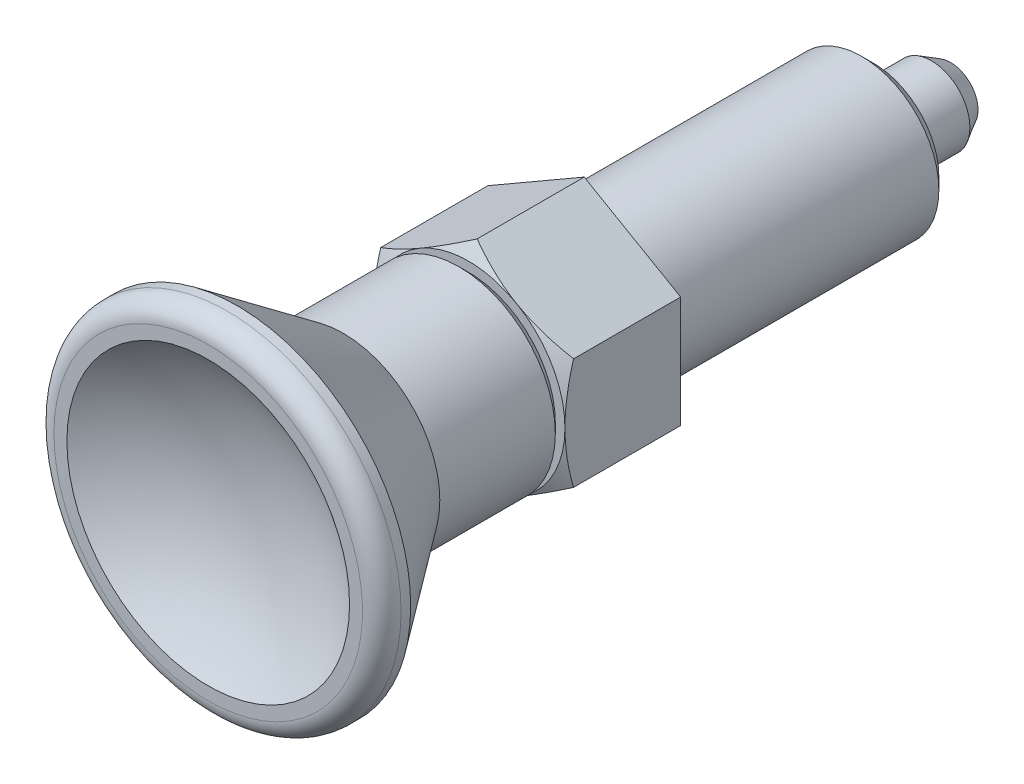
ISO-10303-21;
HEADER;
FILE_DESCRIPTION(('STEP AP214'),'2;1');
FILE_NAME('part.step','',(''),(''),'','','');
FILE_SCHEMA(('AUTOMOTIVE_DESIGN { 1 0 10303 214 1 1 1 1 }'));
ENDSEC;
DATA;
#1=APPLICATION_CONTEXT('core data for automotive mechanical design processes');
#2=APPLICATION_PROTOCOL_DEFINITION('international standard','automotive_design',2000,#1);
#3=PRODUCT_CONTEXT('',#1,'mechanical');
#4=PRODUCT('Part','Part','',(#3));
#5=PRODUCT_RELATED_PRODUCT_CATEGORY('part','',(#4));
#6=PRODUCT_DEFINITION_FORMATION('','',#4);
#7=PRODUCT_DEFINITION_CONTEXT('part definition',#1,'design');
#8=PRODUCT_DEFINITION('design','',#6,#7);
#9=PRODUCT_DEFINITION_SHAPE('','',#8);
#10=(LENGTH_UNIT() NAMED_UNIT(*) SI_UNIT(.MILLI.,.METRE.));
#11=(NAMED_UNIT(*) PLANE_ANGLE_UNIT() SI_UNIT($,.RADIAN.));
#12=(NAMED_UNIT(*) SI_UNIT($,.STERADIAN.) SOLID_ANGLE_UNIT());
#13=UNCERTAINTY_MEASURE_WITH_UNIT(LENGTH_MEASURE(1.E-05),#10,'distance_accuracy_value','');
#14=(GEOMETRIC_REPRESENTATION_CONTEXT(3) GLOBAL_UNCERTAINTY_ASSIGNED_CONTEXT((#13)) GLOBAL_UNIT_ASSIGNED_CONTEXT((#10,
#11,#12)) REPRESENTATION_CONTEXT('',''));
#15=CARTESIAN_POINT('',(0.,0.,0.));
#16=DIRECTION('',(0.,0.,1.));
#17=DIRECTION('',(1.,0.,0.));
#18=AXIS2_PLACEMENT_3D('',#15,#16,#17);
#19=CARTESIAN_POINT('',(5.,2.88675134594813,6.));
#20=DIRECTION('',(-0.5,-0.866025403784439,0.));
#21=DIRECTION('',(0.866025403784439,-0.5,0.));
#22=AXIS2_PLACEMENT_3D('',#19,#20,#21);
#23=PLANE('',#22);
#24=CARTESIAN_POINT('',(5.0002,2.88663587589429,5.55335134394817));
#25=CARTESIAN_POINT('',(4.78046540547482,3.01349970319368,5.62661343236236));
#26=CARTESIAN_POINT('',(4.55885141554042,3.14144859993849,5.69324867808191));
#27=CARTESIAN_POINT('',(4.11178600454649,3.39956193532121,5.80956100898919));
#28=CARTESIAN_POINT('',(3.88632664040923,3.52973095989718,5.85919695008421));
#29=CARTESIAN_POINT('',(3.43816769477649,3.78847564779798,5.9364489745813));
#30=CARTESIAN_POINT('',(3.21553790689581,3.91701101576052,5.96457962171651));
#31=CARTESIAN_POINT('',(2.88081009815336,4.11026620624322,5.98980507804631));
#32=CARTESIAN_POINT('',(2.76915780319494,4.17472868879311,5.99538654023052));
#33=CARTESIAN_POINT('',(2.5457500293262,4.30371322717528,6.00079778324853));
#34=CARTESIAN_POINT('',(2.43399455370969,4.36823528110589,6.0006277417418));
#35=CARTESIAN_POINT('',(2.12781576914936,4.54500768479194,5.99224636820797));
#36=CARTESIAN_POINT('',(1.93349391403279,4.65719946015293,5.97817022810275));
#37=CARTESIAN_POINT('',(1.54613989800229,4.88083840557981,5.93353474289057));
#38=CARTESIAN_POINT('',(1.35310909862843,4.9922847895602,5.90296013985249));
#39=CARTESIAN_POINT('',(0.964974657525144,5.21637431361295,5.82653150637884));
#40=CARTESIAN_POINT('',(0.769920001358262,5.32898917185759,5.78035362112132));
#41=CARTESIAN_POINT('',(0.38271965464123,5.55253939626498,5.67554820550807));
#42=CARTESIAN_POINT('',(0.190569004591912,5.66347762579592,5.61694529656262));
#43=CARTESIAN_POINT('',(-0.000199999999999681,5.7736181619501,5.55335134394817));
#44=B_SPLINE_CURVE_WITH_KNOTS('',3,(#24,#25,#26,#27,#28,#29,#30,#31,#32,#33,#34,#35,#36,#37,#38,
#39,#40,#41,#42,#43),.UNSPECIFIED.,.F.,.F.,(4,2,2,2,2,2,2,2,2,4),(0.,0.792555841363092,
1.58701660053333,2.36181537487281,2.74884076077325,3.13585419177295,3.80962362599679,
4.48401723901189,5.17336882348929,5.86136694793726),.UNSPECIFIED.);
#45=CARTESIAN_POINT('',(5.,2.88675134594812,5.5534180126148));
#46=VERTEX_POINT('',#45);
#47=CARTESIAN_POINT('',(2.5,4.3301270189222,6.));
#48=VERTEX_POINT('',#47);
#49=EDGE_CURVE('E94',#46,#48,#44,.T.);
#50=ORIENTED_EDGE('',*,*,#49,.F.);
#51=DIRECTION('',(0.,0.,-1.));
#52=VECTOR('',#51,1.);
#53=CARTESIAN_POINT('',(5.,2.88675134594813,6.));
#54=LINE('',#53,#52);
#55=CARTESIAN_POINT('',(5.,2.88675134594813,0.));
#56=VERTEX_POINT('',#55);
#57=EDGE_CURVE('E40',#46,#56,#54,.T.);
#58=ORIENTED_EDGE('',*,*,#57,.T.);
#59=DIRECTION('',(-0.866025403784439,0.5,0.));
#60=VECTOR('',#59,1.);
#61=CARTESIAN_POINT('',(5.,2.88675134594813,0.));
#62=LINE('',#61,#60);
#63=CARTESIAN_POINT('',(0.,5.77350269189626,0.));
#64=VERTEX_POINT('',#63);
#65=EDGE_CURVE('E106',#56,#64,#62,.T.);
#66=ORIENTED_EDGE('',*,*,#65,.T.);
#67=DIRECTION('',(0.,0.,-1.));
#68=VECTOR('',#67,1.);
#69=CARTESIAN_POINT('',(0.,5.77350269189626,6.));
#70=LINE('',#69,#68);
#71=CARTESIAN_POINT('',(0.,5.77350269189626,5.5534180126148));
#72=VERTEX_POINT('',#71);
#73=EDGE_CURVE('E133',#72,#64,#70,.T.);
#74=ORIENTED_EDGE('',*,*,#73,.F.);
#75=EDGE_CURVE('E104',#48,#72,#44,.T.);
#76=ORIENTED_EDGE('',*,*,#75,.F.);
#77=EDGE_LOOP('',(#50,#58,#66,#74,#76));
#78=FACE_BOUND('',#77,.T.);
#79=ADVANCED_FACE('F16',(#78),#23,.F.);
#80=CARTESIAN_POINT('',(0.,5.77350269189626,6.));
#81=DIRECTION('',(0.5,-0.866025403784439,0.));
#82=DIRECTION('',(0.866025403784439,0.5,0.));
#83=AXIS2_PLACEMENT_3D('',#80,#81,#82);
#84=PLANE('',#83);
#85=CARTESIAN_POINT('',(0.000200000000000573,5.7736181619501,5.55335134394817));
#86=CARTESIAN_POINT('',(-0.219534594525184,5.64675433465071,5.62661343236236));
#87=CARTESIAN_POINT('',(-0.441148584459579,5.5188054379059,5.69324867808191));
#88=CARTESIAN_POINT('',(-0.888213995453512,5.26069210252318,5.80956100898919));
#89=CARTESIAN_POINT('',(-1.11367335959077,5.13052307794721,5.85919695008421));
#90=CARTESIAN_POINT('',(-1.56183230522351,4.87177839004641,5.9364489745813));
#91=CARTESIAN_POINT('',(-1.78446209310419,4.74324302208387,5.96457962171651));
#92=CARTESIAN_POINT('',(-2.11918990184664,4.54998783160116,5.98980507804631));
#93=CARTESIAN_POINT('',(-2.23084219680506,4.48552534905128,5.99538654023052));
#94=CARTESIAN_POINT('',(-2.4542499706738,4.35654081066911,6.00079778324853));
#95=CARTESIAN_POINT('',(-2.56600544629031,4.2920187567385,6.0006277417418));
#96=CARTESIAN_POINT('',(-2.87218423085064,4.11524635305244,5.99224636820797));
#97=CARTESIAN_POINT('',(-3.06650608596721,4.00305457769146,5.97817022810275));
#98=CARTESIAN_POINT('',(-3.45386010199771,3.77941563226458,5.93353474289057));
#99=CARTESIAN_POINT('',(-3.64689090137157,3.66796924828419,5.90296013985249));
#100=CARTESIAN_POINT('',(-4.03502534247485,3.44387972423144,5.82653150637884));
#101=CARTESIAN_POINT('',(-4.23007999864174,3.3312648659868,5.78035362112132));
#102=CARTESIAN_POINT('',(-4.61728034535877,3.10771464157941,5.67554820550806));
#103=CARTESIAN_POINT('',(-4.80943099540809,2.99677641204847,5.61694529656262));
#104=CARTESIAN_POINT('',(-5.0002,2.88663587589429,5.55335134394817));
#105=B_SPLINE_CURVE_WITH_KNOTS('',3,(#85,#86,#87,#88,#89,#90,#91,#92,#93,#94,#95,#96,#97,#98,
#99,#100,#101,#102,#103,#104),.UNSPECIFIED.,.F.,.F.,(4,2,2,2,2,2,2,2,2,4),(0.,0.79255584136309,
1.58701660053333,2.36181537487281,2.74884076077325,3.13585419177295,3.80962362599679,
4.48401723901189,5.17336882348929,5.86136694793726),.UNSPECIFIED.);
#106=CARTESIAN_POINT('',(-2.5,4.3301270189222,6.));
#107=VERTEX_POINT('',#106);
#108=EDGE_CURVE('E201',#72,#107,#105,.T.);
#109=ORIENTED_EDGE('',*,*,#108,.F.);
#110=ORIENTED_EDGE('',*,*,#73,.T.);
#111=DIRECTION('',(-0.866025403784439,-0.5,0.));
#112=VECTOR('',#111,1.);
#113=CARTESIAN_POINT('',(0.,5.77350269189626,0.));
#114=LINE('',#113,#112);
#115=CARTESIAN_POINT('',(-5.,2.88675134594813,0.));
#116=VERTEX_POINT('',#115);
#117=EDGE_CURVE('E284',#64,#116,#114,.T.);
#118=ORIENTED_EDGE('',*,*,#117,.T.);
#119=DIRECTION('',(0.,0.,-1.));
#120=VECTOR('',#119,1.);
#121=CARTESIAN_POINT('',(-5.,2.88675134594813,6.));
#122=LINE('',#121,#120);
#123=CARTESIAN_POINT('',(-5.,2.88675134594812,5.5534180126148));
#124=VERTEX_POINT('',#123);
#125=EDGE_CURVE('E130',#124,#116,#122,.T.);
#126=ORIENTED_EDGE('',*,*,#125,.F.);
#127=EDGE_CURVE('E202',#107,#124,#105,.T.);
#128=ORIENTED_EDGE('',*,*,#127,.F.);
#129=EDGE_LOOP('',(#109,#110,#118,#126,#128));
#130=FACE_BOUND('',#129,.T.);
#131=ADVANCED_FACE('F179',(#130),#84,.F.);
#132=CARTESIAN_POINT('',(-5.,2.88675134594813,6.));
#133=DIRECTION('',(1.,0.,0.));
#134=DIRECTION('',(0.,0.,-1.));
#135=AXIS2_PLACEMENT_3D('',#132,#133,#134);
#136=PLANE('',#135);
#137=CARTESIAN_POINT('',(-5.,8.67769989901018,3.10452353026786));
#138=CARTESIAN_POINT('',(-5.,8.46999549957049,3.20841167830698));
#139=CARTESIAN_POINT('',(-5.,8.26192857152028,3.3115826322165));
#140=CARTESIAN_POINT('',(-5.,7.84490442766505,3.51614356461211));
#141=CARTESIAN_POINT('',(-5.,7.63594715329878,3.61753342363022));
#142=CARTESIAN_POINT('',(-5.,7.2165824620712,3.81837386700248));
#143=CARTESIAN_POINT('',(-5.,7.00617297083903,3.91782012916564));
#144=CARTESIAN_POINT('',(-5.,6.58413282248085,4.11408085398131));
#145=CARTESIAN_POINT('',(-5.,6.37250218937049,4.21089536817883));
#146=CARTESIAN_POINT('',(-5.,5.93822918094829,4.40556869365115));
#147=CARTESIAN_POINT('',(-5.,5.71551978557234,4.50327849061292));
#148=CARTESIAN_POINT('',(-5.,5.26820250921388,4.69424698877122));
#149=CARTESIAN_POINT('',(-5.,5.04359469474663,4.78750584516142));
#150=CARTESIAN_POINT('',(-5.,4.59223463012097,4.96832455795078));
#151=CARTESIAN_POINT('',(-5.,4.36548370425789,5.05588769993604));
#152=CARTESIAN_POINT('',(-5.,3.90933222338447,5.22378244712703));
#153=CARTESIAN_POINT('',(-5.,3.67993196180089,5.30411484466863));
#154=CARTESIAN_POINT('',(-5.,3.1639048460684,5.47329194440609));
#155=CARTESIAN_POINT('',(-5.,2.87647211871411,5.55971587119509));
#156=CARTESIAN_POINT('',(-5.,2.29642431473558,5.71355971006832));
#157=CARTESIAN_POINT('',(-5.,2.00380970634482,5.78098132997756));
#158=CARTESIAN_POINT('',(-5.,1.56391876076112,5.86312218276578));
#159=CARTESIAN_POINT('',(-5.,1.41837577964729,5.8872097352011));
#160=CARTESIAN_POINT('',(-5.,1.12635842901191,5.92878586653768));
#161=CARTESIAN_POINT('',(-5.,0.979884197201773,5.94627539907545));
#162=CARTESIAN_POINT('',(-5.,0.686297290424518,5.97413236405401));
#163=CARTESIAN_POINT('',(-5.,0.539184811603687,5.98450184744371));
#164=CARTESIAN_POINT('',(-5.,0.244620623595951,5.99779052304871));
#165=CARTESIAN_POINT('',(-5.,0.0971689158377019,6.00070974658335));
#166=CARTESIAN_POINT('',(-5.,-0.198573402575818,5.99899344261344));
#167=CARTESIAN_POINT('',(-5.,-0.346863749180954,5.99431256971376));
#168=CARTESIAN_POINT('',(-5.,-0.643014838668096,5.97747027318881));
#169=CARTESIAN_POINT('',(-5.,-0.79087557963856,5.96530881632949));
#170=CARTESIAN_POINT('',(-5.,-1.08589204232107,5.93389230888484));
#171=CARTESIAN_POINT('',(-5.,-1.23304747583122,5.91463457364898));
#172=CARTESIAN_POINT('',(-5.,-1.52634780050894,5.86959263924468));
#173=CARTESIAN_POINT('',(-5.,-1.67249265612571,5.84380821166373));
#174=CARTESIAN_POINT('',(-5.,-2.1140899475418,5.75668256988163));
#175=CARTESIAN_POINT('',(-5.,-2.40773999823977,5.68613563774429));
#176=CARTESIAN_POINT('',(-5.,-2.98996510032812,5.52649261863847));
#177=CARTESIAN_POINT('',(-5.,-3.27853719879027,5.43738610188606));
#178=CARTESIAN_POINT('',(-5.,-3.79024179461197,5.26587062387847));
#179=CARTESIAN_POINT('',(-5.,-4.01425747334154,5.18605773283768));
#180=CARTESIAN_POINT('',(-5.,-4.45972536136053,5.01978602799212));
#181=CARTESIAN_POINT('',(-5.,-4.68117825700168,4.93332904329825));
#182=CARTESIAN_POINT('',(-5.,-5.12210633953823,4.75511770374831));
#183=CARTESIAN_POINT('',(-5.,-5.34158006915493,4.66335976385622));
#184=CARTESIAN_POINT('',(-5.,-5.77874375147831,4.47568479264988));
#185=CARTESIAN_POINT('',(-5.,-5.99643364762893,4.37976763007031));
#186=CARTESIAN_POINT('',(-5.,-6.42115057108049,4.18872983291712));
#187=CARTESIAN_POINT('',(-5.,-6.62823962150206,4.09374666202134));
#188=CARTESIAN_POINT('',(-5.,-7.04125269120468,3.90129295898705));
#189=CARTESIAN_POINT('',(-5.,-7.24717672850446,3.803822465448));
#190=CARTESIAN_POINT('',(-5.,-7.65767872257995,3.60701139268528));
#191=CARTESIAN_POINT('',(-5.,-7.86225841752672,3.50767443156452));
#192=CARTESIAN_POINT('',(-5.,-8.27057470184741,3.30729574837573));
#193=CARTESIAN_POINT('',(-5.,-8.47431131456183,3.20625407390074));
#194=CARTESIAN_POINT('',(-5.,-8.67769989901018,3.10452353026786));
#195=B_SPLINE_CURVE_WITH_KNOTS('',3,(#137,#138,#139,#140,#141,#142,#143,#144,#145,#146,#147,
#148,#149,#150,#151,#152,#153,#154,#155,#156,#157,#158,#159,#160,#161,#162,#163,#164,#165,#166,
#167,#168,#169,#170,#171,#172,#173,#174,#175,#176,#177,#178,#179,#180,#181,#182,#183,#184,#185,
#186,#187,#188,#189,#190,#191,#192,#193,#194),.UNSPECIFIED.,.F.,.F.,(4,2,2,2,2,2,2,2,2,2,2,2,2,
2,2,2,2,2,2,2,2,2,2,2,2,2,2,2,4),(0.,0.696713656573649,1.39347386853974,2.09163890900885,
2.78979026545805,3.51935463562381,4.24889354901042,4.9780078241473,5.70704210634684,
6.60702023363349,7.50691744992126,7.94935972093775,8.39173801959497,8.83398883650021,
9.27623779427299,9.72113510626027,10.1660343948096,10.6111021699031,11.0561855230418,
11.9612951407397,12.8669147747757,13.58021856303,14.2933266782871,15.0069228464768,
15.720541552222,16.4040197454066,17.0874873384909,17.7697443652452,18.4519823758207),.UNSPECIFIED.);
#196=CARTESIAN_POINT('',(-5.,0.,6.));
#197=VERTEX_POINT('',#196);
#198=EDGE_CURVE('E250',#124,#197,#195,.T.);
#199=ORIENTED_EDGE('',*,*,#198,.F.);
#200=ORIENTED_EDGE('',*,*,#125,.T.);
#201=DIRECTION('',(0.,-1.,0.));
#202=VECTOR('',#201,1.);
#203=CARTESIAN_POINT('',(-5.,2.88675134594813,0.));
#204=LINE('',#203,#202);
#205=CARTESIAN_POINT('',(-5.,-2.88675134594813,0.));
#206=VERTEX_POINT('',#205);
#207=EDGE_CURVE('E289',#116,#206,#204,.T.);
#208=ORIENTED_EDGE('',*,*,#207,.T.);
#209=DIRECTION('',(0.,0.,-1.));
#210=VECTOR('',#209,1.);
#211=CARTESIAN_POINT('',(-5.,-2.88675134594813,6.));
#212=LINE('',#211,#210);
#213=CARTESIAN_POINT('',(-5.,-2.88675134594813,5.5534180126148));
#214=VERTEX_POINT('',#213);
#215=EDGE_CURVE('E127',#214,#206,#212,.T.);
#216=ORIENTED_EDGE('',*,*,#215,.F.);
#217=EDGE_CURVE('E244',#197,#214,#195,.T.);
#218=ORIENTED_EDGE('',*,*,#217,.F.);
#219=EDGE_LOOP('',(#199,#200,#208,#216,#218));
#220=FACE_BOUND('',#219,.T.);
#221=ADVANCED_FACE('F185',(#220),#136,.F.);
#222=CARTESIAN_POINT('',(-5.,-2.88675134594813,6.));
#223=DIRECTION('',(0.5,0.866025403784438,0.));
#224=DIRECTION('',(-0.866025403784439,0.5,0.));
#225=AXIS2_PLACEMENT_3D('',#222,#223,#224);
#226=PLANE('',#225);
#227=CARTESIAN_POINT('',(-5.0002,-2.88663587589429,5.55335134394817));
#228=CARTESIAN_POINT('',(-4.78046540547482,-3.01349970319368,5.62661343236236));
#229=CARTESIAN_POINT('',(-4.55885141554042,-3.14144859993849,5.69324867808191));
#230=CARTESIAN_POINT('',(-4.11178600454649,-3.39956193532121,5.80956100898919));
#231=CARTESIAN_POINT('',(-3.88632664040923,-3.52973095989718,5.85919695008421));
#232=CARTESIAN_POINT('',(-3.43816769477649,-3.78847564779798,5.9364489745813));
#233=CARTESIAN_POINT('',(-3.21553790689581,-3.91701101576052,5.96457962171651));
#234=CARTESIAN_POINT('',(-2.88081009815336,-4.11026620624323,5.98980507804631));
#235=CARTESIAN_POINT('',(-2.76915780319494,-4.17472868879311,5.99538654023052));
#236=CARTESIAN_POINT('',(-2.5457500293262,-4.30371322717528,6.00079778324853));
#237=CARTESIAN_POINT('',(-2.43399455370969,-4.36823528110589,6.0006277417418));
#238=CARTESIAN_POINT('',(-2.12781576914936,-4.54500768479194,5.99224636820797));
#239=CARTESIAN_POINT('',(-1.93349391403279,-4.65719946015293,5.97817022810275));
#240=CARTESIAN_POINT('',(-1.5461398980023,-4.88083840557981,5.93353474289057));
#241=CARTESIAN_POINT('',(-1.35310909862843,-4.9922847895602,5.90296013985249));
#242=CARTESIAN_POINT('',(-0.964974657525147,-5.21637431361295,5.82653150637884));
#243=CARTESIAN_POINT('',(-0.769920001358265,-5.32898917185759,5.78035362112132));
#244=CARTESIAN_POINT('',(-0.382719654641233,-5.55253939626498,5.67554820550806));
#245=CARTESIAN_POINT('',(-0.190569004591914,-5.66347762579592,5.61694529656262));
#246=CARTESIAN_POINT('',(0.000199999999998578,-5.7736181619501,5.55335134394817));
#247=B_SPLINE_CURVE_WITH_KNOTS('',3,(#227,#228,#229,#230,#231,#232,#233,#234,#235,#236,#237,
#238,#239,#240,#241,#242,#243,#244,#245,#246),.UNSPECIFIED.,.F.,.F.,(4,2,2,2,2,2,2,2,2,4),(0.,
0.792555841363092,1.58701660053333,2.36181537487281,2.74884076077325,3.13585419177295,
3.80962362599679,4.48401723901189,5.17336882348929,5.86136694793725),.UNSPECIFIED.);
#248=CARTESIAN_POINT('',(-2.5,-4.33012701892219,6.));
#249=VERTEX_POINT('',#248);
#250=EDGE_CURVE('E251',#214,#249,#247,.T.);
#251=ORIENTED_EDGE('',*,*,#250,.F.);
#252=ORIENTED_EDGE('',*,*,#215,.T.);
#253=DIRECTION('',(0.866025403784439,-0.5,0.));
#254=VECTOR('',#253,1.);
#255=CARTESIAN_POINT('',(-5.,-2.88675134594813,0.));
#256=LINE('',#255,#254);
#257=CARTESIAN_POINT('',(0.,-5.77350269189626,0.));
#258=VERTEX_POINT('',#257);
#259=EDGE_CURVE('E294',#206,#258,#256,.T.);
#260=ORIENTED_EDGE('',*,*,#259,.T.);
#261=DIRECTION('',(0.,0.,-1.));
#262=VECTOR('',#261,1.);
#263=CARTESIAN_POINT('',(0.,-5.77350269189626,6.));
#264=LINE('',#263,#262);
#265=CARTESIAN_POINT('',(0.,-5.77350269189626,5.5534180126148));
#266=VERTEX_POINT('',#265);
#267=EDGE_CURVE('E118',#266,#258,#264,.T.);
#268=ORIENTED_EDGE('',*,*,#267,.F.);
#269=EDGE_CURVE('E238',#249,#266,#247,.T.);
#270=ORIENTED_EDGE('',*,*,#269,.F.);
#271=EDGE_LOOP('',(#251,#252,#260,#268,#270));
#272=FACE_BOUND('',#271,.T.);
#273=ADVANCED_FACE('F254',(#272),#226,.F.);
#274=CARTESIAN_POINT('',(0.,-5.77350269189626,6.));
#275=DIRECTION('',(-0.5,0.866025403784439,0.));
#276=DIRECTION('',(-0.866025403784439,-0.5,0.));
#277=AXIS2_PLACEMENT_3D('',#274,#275,#276);
#278=PLANE('',#277);
#279=CARTESIAN_POINT('',(-0.000200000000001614,-5.7736181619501,5.55335134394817));
#280=CARTESIAN_POINT('',(0.219534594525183,-5.64675433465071,5.62661343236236));
#281=CARTESIAN_POINT('',(0.441148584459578,-5.5188054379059,5.69324867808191));
#282=CARTESIAN_POINT('',(0.888213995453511,-5.26069210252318,5.80956100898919));
#283=CARTESIAN_POINT('',(1.11367335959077,-5.13052307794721,5.85919695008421));
#284=CARTESIAN_POINT('',(1.56183230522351,-4.87177839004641,5.9364489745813));
#285=CARTESIAN_POINT('',(1.78446209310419,-4.74324302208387,5.96457962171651));
#286=CARTESIAN_POINT('',(2.11918990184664,-4.54998783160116,5.98980507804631));
#287=CARTESIAN_POINT('',(2.23084219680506,-4.48552534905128,5.99538654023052));
#288=CARTESIAN_POINT('',(2.4542499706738,-4.35654081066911,6.00079778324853));
#289=CARTESIAN_POINT('',(2.56600544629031,-4.2920187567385,6.0006277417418));
#290=CARTESIAN_POINT('',(2.87218423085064,-4.11524635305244,5.99224636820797));
#291=CARTESIAN_POINT('',(3.06650608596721,-4.00305457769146,5.97817022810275));
#292=CARTESIAN_POINT('',(3.4538601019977,-3.77941563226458,5.93353474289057));
#293=CARTESIAN_POINT('',(3.64689090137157,-3.66796924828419,5.90296013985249));
#294=CARTESIAN_POINT('',(4.03502534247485,-3.44387972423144,5.82653150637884));
#295=CARTESIAN_POINT('',(4.23007999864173,-3.3312648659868,5.78035362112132));
#296=CARTESIAN_POINT('',(4.61728034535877,-3.10771464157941,5.67554820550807));
#297=CARTESIAN_POINT('',(4.80943099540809,-2.99677641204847,5.61694529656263));
#298=CARTESIAN_POINT('',(5.0002,-2.88663587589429,5.55335134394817));
#299=B_SPLINE_CURVE_WITH_KNOTS('',3,(#279,#280,#281,#282,#283,#284,#285,#286,#287,#288,#289,
#290,#291,#292,#293,#294,#295,#296,#297,#298),.UNSPECIFIED.,.F.,.F.,(4,2,2,2,2,2,2,2,2,4),(0.,
0.79255584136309,1.58701660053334,2.36181537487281,2.74884076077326,3.13585419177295,
3.80962362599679,4.48401723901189,5.17336882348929,5.86136694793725),.UNSPECIFIED.);
#300=CARTESIAN_POINT('',(2.5,-4.3301270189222,6.));
#301=VERTEX_POINT('',#300);
#302=EDGE_CURVE('E331',#266,#301,#299,.T.);
#303=ORIENTED_EDGE('',*,*,#302,.F.);
#304=ORIENTED_EDGE('',*,*,#267,.T.);
#305=DIRECTION('',(0.866025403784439,0.5,0.));
#306=VECTOR('',#305,1.);
#307=CARTESIAN_POINT('',(0.,-5.77350269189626,0.));
#308=LINE('',#307,#306);
#309=CARTESIAN_POINT('',(5.,-2.88675134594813,0.));
#310=VERTEX_POINT('',#309);
#311=EDGE_CURVE('E121',#258,#310,#308,.T.);
#312=ORIENTED_EDGE('',*,*,#311,.T.);
#313=DIRECTION('',(0.,0.,-1.));
#314=VECTOR('',#313,1.);
#315=CARTESIAN_POINT('',(5.,-2.88675134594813,6.));
#316=LINE('',#315,#314);
#317=CARTESIAN_POINT('',(5.,-2.88675134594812,5.5534180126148));
#318=VERTEX_POINT('',#317);
#319=EDGE_CURVE('E113',#318,#310,#316,.T.);
#320=ORIENTED_EDGE('',*,*,#319,.F.);
#321=EDGE_CURVE('E230',#301,#318,#299,.T.);
#322=ORIENTED_EDGE('',*,*,#321,.F.);
#323=EDGE_LOOP('',(#303,#304,#312,#320,#322));
#324=FACE_BOUND('',#323,.T.);
#325=ADVANCED_FACE('F258',(#324),#278,.F.);
#326=CARTESIAN_POINT('',(5.,-2.88675134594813,6.));
#327=DIRECTION('',(-1.,0.,0.));
#328=DIRECTION('',(0.,0.,1.));
#329=AXIS2_PLACEMENT_3D('',#326,#327,#328);
#330=PLANE('',#329);
#331=CARTESIAN_POINT('',(5.,-8.67769989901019,3.10452353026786));
#332=CARTESIAN_POINT('',(5.,-8.46999549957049,3.20841167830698));
#333=CARTESIAN_POINT('',(5.,-8.26192857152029,3.3115826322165));
#334=CARTESIAN_POINT('',(5.,-7.84490442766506,3.5161435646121));
#335=CARTESIAN_POINT('',(5.,-7.63594715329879,3.61753342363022));
#336=CARTESIAN_POINT('',(5.,-7.2165824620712,3.81837386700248));
#337=CARTESIAN_POINT('',(5.,-7.00617297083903,3.91782012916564));
#338=CARTESIAN_POINT('',(5.,-6.58413282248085,4.1140808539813));
#339=CARTESIAN_POINT('',(5.,-6.37250218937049,4.21089536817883));
#340=CARTESIAN_POINT('',(5.,-5.93822918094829,4.40556869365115));
#341=CARTESIAN_POINT('',(5.,-5.71551978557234,4.50327849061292));
#342=CARTESIAN_POINT('',(5.,-5.26820250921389,4.69424698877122));
#343=CARTESIAN_POINT('',(5.,-5.04359469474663,4.78750584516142));
#344=CARTESIAN_POINT('',(5.,-4.59223463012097,4.96832455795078));
#345=CARTESIAN_POINT('',(5.,-4.36548370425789,5.05588769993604));
#346=CARTESIAN_POINT('',(5.,-3.90933222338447,5.22378244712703));
#347=CARTESIAN_POINT('',(5.,-3.67993196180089,5.30411484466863));
#348=CARTESIAN_POINT('',(5.,-3.1639048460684,5.47329194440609));
#349=CARTESIAN_POINT('',(5.,-2.87647211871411,5.55971587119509));
#350=CARTESIAN_POINT('',(5.,-2.29642431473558,5.71355971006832));
#351=CARTESIAN_POINT('',(5.,-2.00380970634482,5.78098132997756));
#352=CARTESIAN_POINT('',(5.,-1.56391876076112,5.86312218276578));
#353=CARTESIAN_POINT('',(5.,-1.41837577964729,5.8872097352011));
#354=CARTESIAN_POINT('',(5.,-1.12635842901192,5.92878586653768));
#355=CARTESIAN_POINT('',(5.,-0.979884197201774,5.94627539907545));
#356=CARTESIAN_POINT('',(5.,-0.68629729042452,5.97413236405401));
#357=CARTESIAN_POINT('',(5.,-0.539184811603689,5.98450184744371));
#358=CARTESIAN_POINT('',(5.,-0.244620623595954,5.99779052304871));
#359=CARTESIAN_POINT('',(5.,-0.0971689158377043,6.00070974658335));
#360=CARTESIAN_POINT('',(5.,0.198573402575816,5.99899344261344));
#361=CARTESIAN_POINT('',(5.,0.346863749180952,5.99431256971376));
#362=CARTESIAN_POINT('',(5.,0.643014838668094,5.97747027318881));
#363=CARTESIAN_POINT('',(5.,0.790875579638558,5.96530881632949));
#364=CARTESIAN_POINT('',(5.,1.08589204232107,5.93389230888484));
#365=CARTESIAN_POINT('',(5.,1.23304747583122,5.91463457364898));
#366=CARTESIAN_POINT('',(5.,1.52634780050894,5.86959263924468));
#367=CARTESIAN_POINT('',(5.,1.67249265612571,5.84380821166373));
#368=CARTESIAN_POINT('',(5.,2.11408994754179,5.75668256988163));
#369=CARTESIAN_POINT('',(5.,2.40773999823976,5.68613563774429));
#370=CARTESIAN_POINT('',(5.,2.98996510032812,5.52649261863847));
#371=CARTESIAN_POINT('',(5.,3.27853719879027,5.43738610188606));
#372=CARTESIAN_POINT('',(5.,3.79024179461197,5.26587062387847));
#373=CARTESIAN_POINT('',(5.,4.01425747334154,5.18605773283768));
#374=CARTESIAN_POINT('',(5.,4.45972536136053,5.01978602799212));
#375=CARTESIAN_POINT('',(5.,4.68117825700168,4.93332904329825));
#376=CARTESIAN_POINT('',(5.,5.12210633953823,4.75511770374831));
#377=CARTESIAN_POINT('',(5.,5.34158006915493,4.66335976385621));
#378=CARTESIAN_POINT('',(5.,5.77874375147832,4.47568479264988));
#379=CARTESIAN_POINT('',(5.,5.99643364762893,4.37976763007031));
#380=CARTESIAN_POINT('',(5.,6.42115057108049,4.18872983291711));
#381=CARTESIAN_POINT('',(5.,6.62823962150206,4.09374666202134));
#382=CARTESIAN_POINT('',(5.,7.04125269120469,3.90129295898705));
#383=CARTESIAN_POINT('',(5.,7.24717672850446,3.803822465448));
#384=CARTESIAN_POINT('',(5.,7.65767872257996,3.60701139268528));
#385=CARTESIAN_POINT('',(5.,7.86225841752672,3.50767443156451));
#386=CARTESIAN_POINT('',(5.,8.27057470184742,3.30729574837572));
#387=CARTESIAN_POINT('',(5.,8.47431131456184,3.20625407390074));
#388=CARTESIAN_POINT('',(5.,8.67769989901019,3.10452353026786));
#389=B_SPLINE_CURVE_WITH_KNOTS('',3,(#331,#332,#333,#334,#335,#336,#337,#338,#339,#340,#341,
#342,#343,#344,#345,#346,#347,#348,#349,#350,#351,#352,#353,#354,#355,#356,#357,#358,#359,#360,
#361,#362,#363,#364,#365,#366,#367,#368,#369,#370,#371,#372,#373,#374,#375,#376,#377,#378,#379,
#380,#381,#382,#383,#384,#385,#386,#387,#388),.UNSPECIFIED.,.F.,.F.,(4,2,2,2,2,2,2,2,2,2,2,2,2,
2,2,2,2,2,2,2,2,2,2,2,2,2,2,2,4),(0.,0.696713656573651,1.39347386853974,2.09163890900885,
2.78979026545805,3.51935463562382,4.24889354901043,4.97800782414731,5.70704210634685,
6.6070202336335,7.50691744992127,7.94935972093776,8.39173801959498,8.83398883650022,
9.276237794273,9.72113510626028,10.1660343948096,10.6111021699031,11.0561855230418,
11.9612951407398,12.8669147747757,13.58021856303,14.2933266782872,15.0069228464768,
15.7205415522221,16.4040197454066,17.0874873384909,17.7697443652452,18.4519823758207),.UNSPECIFIED.);
#390=CARTESIAN_POINT('',(5.,0.,6.));
#391=VERTEX_POINT('',#390);
#392=EDGE_CURVE('E100',#318,#391,#389,.T.);
#393=ORIENTED_EDGE('',*,*,#392,.F.);
#394=ORIENTED_EDGE('',*,*,#319,.T.);
#395=DIRECTION('',(0.,1.,0.));
#396=VECTOR('',#395,1.);
#397=CARTESIAN_POINT('',(5.,-2.88675134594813,0.));
#398=LINE('',#397,#396);
#399=EDGE_CURVE('E110',#310,#56,#398,.T.);
#400=ORIENTED_EDGE('',*,*,#399,.T.);
#401=ORIENTED_EDGE('',*,*,#57,.F.);
#402=EDGE_CURVE('E92',#391,#46,#389,.T.);
#403=ORIENTED_EDGE('',*,*,#402,.F.);
#404=EDGE_LOOP('',(#393,#394,#400,#401,#403));
#405=FACE_BOUND('',#404,.T.);
#406=ADVANCED_FACE('F108',(#405),#330,.F.);
#407=CARTESIAN_POINT('',(-2.,0.,-15.));
#408=DIRECTION('',(0.,0.,1.));
#409=DIRECTION('',(1.,0.,0.));
#410=AXIS2_PLACEMENT_3D('',#407,#408,#409);
#411=PLANE('',#410);
#412=CARTESIAN_POINT('',(0.,0.,-15.));
#413=DIRECTION('',(0.,0.,1.));
#414=DIRECTION('',(1.,0.,0.));
#415=AXIS2_PLACEMENT_3D('',#412,#413,#414);
#416=CIRCLE('',#415,3.39);
#417=CARTESIAN_POINT('',(3.39,0.,-15.));
#418=VERTEX_POINT('',#417);
#419=EDGE_CURVE('E152',#418,#418,#416,.F.);
#420=ORIENTED_EDGE('',*,*,#419,.T.);
#421=EDGE_LOOP('',(#420));
#422=FACE_BOUND('',#421,.T.);
#423=CARTESIAN_POINT('',(0.,0.,-15.));
#424=DIRECTION('',(0.,0.,1.));
#425=DIRECTION('',(1.,0.,0.));
#426=AXIS2_PLACEMENT_3D('',#423,#424,#425);
#427=CIRCLE('',#426,2.);
#428=CARTESIAN_POINT('',(2.,0.,-15.));
#429=VERTEX_POINT('',#428);
#430=EDGE_CURVE('E140',#429,#429,#427,.T.);
#431=ORIENTED_EDGE('',*,*,#430,.T.);
#432=EDGE_LOOP('',(#431));
#433=FACE_BOUND('',#432,.T.);
#434=ADVANCED_FACE('F265',(#422,#433),#411,.F.);
#435=CARTESIAN_POINT('',(0.,0.,0.));
#436=DIRECTION('',(0.,0.,1.));
#437=DIRECTION('',(1.,0.,0.));
#438=AXIS2_PLACEMENT_3D('',#435,#436,#437);
#439=CYLINDRICAL_SURFACE('',#438,2.);
#440=CARTESIAN_POINT('',(0.,0.,-18.));
#441=DIRECTION('',(0.,0.,-1.));
#442=DIRECTION('',(-1.,0.,0.));
#443=AXIS2_PLACEMENT_3D('',#440,#441,#442);
#444=CIRCLE('',#443,2.);
#445=CARTESIAN_POINT('',(-2.,0.,-18.));
#446=VERTEX_POINT('',#445);
#447=EDGE_CURVE('E343',#446,#446,#444,.T.);
#448=ORIENTED_EDGE('',*,*,#447,.F.);
#449=EDGE_LOOP('',(#448));
#450=FACE_BOUND('',#449,.T.);
#451=ORIENTED_EDGE('',*,*,#430,.F.);
#452=EDGE_LOOP('',(#451));
#453=FACE_BOUND('',#452,.T.);
#454=ADVANCED_FACE('F276',(#450,#453),#439,.T.);
#455=CARTESIAN_POINT('',(0.,0.,0.));
#456=DIRECTION('',(0.,0.,1.));
#457=DIRECTION('',(1.,0.,0.));
#458=AXIS2_PLACEMENT_3D('',#455,#456,#457);
#459=CYLINDRICAL_SURFACE('',#458,4.);
#460=CARTESIAN_POINT('',(0.,0.,-14.39));
#461=DIRECTION('',(0.,0.,1.));
#462=DIRECTION('',(1.,0.,0.));
#463=AXIS2_PLACEMENT_3D('',#460,#461,#462);
#464=CIRCLE('',#463,4.);
#465=CARTESIAN_POINT('',(4.,0.,-14.39));
#466=VERTEX_POINT('',#465);
#467=EDGE_CURVE('E148',#466,#466,#464,.T.);
#468=ORIENTED_EDGE('',*,*,#467,.T.);
#469=EDGE_LOOP('',(#468));
#470=FACE_BOUND('',#469,.T.);
#471=CARTESIAN_POINT('',(0.,0.,0.));
#472=DIRECTION('',(0.,0.,1.));
#473=DIRECTION('',(1.,0.,0.));
#474=AXIS2_PLACEMENT_3D('',#471,#472,#473);
#475=CIRCLE('',#474,4.);
#476=CARTESIAN_POINT('',(4.,0.,0.));
#477=VERTEX_POINT('',#476);
#478=EDGE_CURVE('E136',#477,#477,#475,.T.);
#479=ORIENTED_EDGE('',*,*,#478,.F.);
#480=EDGE_LOOP('',(#479));
#481=FACE_BOUND('',#480,.T.);
#482=ADVANCED_FACE('F192',(#470,#481),#459,.T.);
#483=CARTESIAN_POINT('',(0.,0.,0.));
#484=DIRECTION('',(0.,0.,1.));
#485=DIRECTION('',(1.,0.,0.));
#486=AXIS2_PLACEMENT_3D('',#483,#484,#485);
#487=PLANE('',#486);
#488=ORIENTED_EDGE('',*,*,#478,.T.);
#489=EDGE_LOOP('',(#488));
#490=FACE_BOUND('',#489,.T.);
#491=ORIENTED_EDGE('',*,*,#65,.F.);
#492=ORIENTED_EDGE('',*,*,#399,.F.);
#493=ORIENTED_EDGE('',*,*,#311,.F.);
#494=ORIENTED_EDGE('',*,*,#259,.F.);
#495=ORIENTED_EDGE('',*,*,#207,.F.);
#496=ORIENTED_EDGE('',*,*,#117,.F.);
#497=EDGE_LOOP('',(#491,#492,#493,#494,#495,#496));
#498=FACE_BOUND('',#497,.T.);
#499=ADVANCED_FACE('F266',(#490,#498),#487,.F.);
#500=CARTESIAN_POINT('',(0.,0.,6.));
#501=DIRECTION('',(0.,0.,-1.));
#502=DIRECTION('',(-1.,0.,0.));
#503=AXIS2_PLACEMENT_3D('',#500,#501,#502);
#504=CONICAL_SURFACE('',#503,5.,1.0471975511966);
#505=ORIENTED_EDGE('',*,*,#321,.T.);
#506=ORIENTED_EDGE('',*,*,#392,.T.);
#507=CARTESIAN_POINT('',(0.,0.,6.));
#508=DIRECTION('',(0.,0.,1.));
#509=DIRECTION('',(1.,0.,0.));
#510=AXIS2_PLACEMENT_3D('',#507,#508,#509);
#511=CIRCLE('',#510,5.);
#512=EDGE_CURVE('E32',#301,#391,#511,.T.);
#513=ORIENTED_EDGE('',*,*,#512,.F.);
#514=EDGE_LOOP('',(#505,#506,#513));
#515=FACE_BOUND('',#514,.T.);
#516=ADVANCED_FACE('F215',(#515),#504,.T.);
#517=ORIENTED_EDGE('',*,*,#269,.T.);
#518=ORIENTED_EDGE('',*,*,#302,.T.);
#519=EDGE_CURVE('E146',#249,#301,#511,.T.);
#520=ORIENTED_EDGE('',*,*,#519,.F.);
#521=EDGE_LOOP('',(#517,#518,#520));
#522=FACE_BOUND('',#521,.T.);
#523=ADVANCED_FACE('F274',(#522),#504,.T.);
#524=ORIENTED_EDGE('',*,*,#217,.T.);
#525=ORIENTED_EDGE('',*,*,#250,.T.);
#526=EDGE_CURVE('E325',#197,#249,#511,.T.);
#527=ORIENTED_EDGE('',*,*,#526,.F.);
#528=EDGE_LOOP('',(#524,#525,#527));
#529=FACE_BOUND('',#528,.T.);
#530=ADVANCED_FACE('F326',(#529),#504,.T.);
#531=ORIENTED_EDGE('',*,*,#127,.T.);
#532=ORIENTED_EDGE('',*,*,#198,.T.);
#533=EDGE_CURVE('E321',#107,#197,#511,.T.);
#534=ORIENTED_EDGE('',*,*,#533,.F.);
#535=EDGE_LOOP('',(#531,#532,#534));
#536=FACE_BOUND('',#535,.T.);
#537=ADVANCED_FACE('F319',(#536),#504,.T.);
#538=ORIENTED_EDGE('',*,*,#75,.T.);
#539=ORIENTED_EDGE('',*,*,#108,.T.);
#540=EDGE_CURVE('E147',#48,#107,#511,.T.);
#541=ORIENTED_EDGE('',*,*,#540,.F.);
#542=EDGE_LOOP('',(#538,#539,#541));
#543=FACE_BOUND('',#542,.T.);
#544=ADVANCED_FACE('F214',(#543),#504,.T.);
#545=ORIENTED_EDGE('',*,*,#49,.T.);
#546=CARTESIAN_POINT('',(0.,0.,6.));
#547=DIRECTION('',(0.,0.,1.));
#548=DIRECTION('',(1.,0.,0.));
#549=AXIS2_PLACEMENT_3D('',#546,#547,#548);
#550=CIRCLE('',#549,5.);
#551=EDGE_CURVE('E96',#391,#48,#550,.T.);
#552=ORIENTED_EDGE('',*,*,#551,.F.);
#553=ORIENTED_EDGE('',*,*,#402,.T.);
#554=EDGE_LOOP('',(#545,#552,#553));
#555=FACE_BOUND('',#554,.T.);
#556=ADVANCED_FACE('F93',(#555),#504,.T.);
#557=CARTESIAN_POINT('',(0.,0.,6.));
#558=DIRECTION('',(0.,0.,1.));
#559=DIRECTION('',(1.,0.,0.));
#560=AXIS2_PLACEMENT_3D('',#557,#558,#559);
#561=PLANE('',#560);
#562=CARTESIAN_POINT('',(0.,0.,6.));
#563=DIRECTION('',(0.,0.,1.));
#564=DIRECTION('',(1.,0.,0.));
#565=AXIS2_PLACEMENT_3D('',#562,#563,#564);
#566=CIRCLE('',#565,4.5);
#567=CARTESIAN_POINT('',(4.5,0.,6.));
#568=VERTEX_POINT('',#567);
#569=EDGE_CURVE('E354',#568,#568,#566,.T.);
#570=ORIENTED_EDGE('',*,*,#569,.F.);
#571=EDGE_LOOP('',(#570));
#572=FACE_BOUND('',#571,.T.);
#573=ORIENTED_EDGE('',*,*,#512,.T.);
#574=ORIENTED_EDGE('',*,*,#551,.T.);
#575=ORIENTED_EDGE('',*,*,#540,.T.);
#576=ORIENTED_EDGE('',*,*,#533,.T.);
#577=ORIENTED_EDGE('',*,*,#526,.T.);
#578=ORIENTED_EDGE('',*,*,#519,.T.);
#579=EDGE_LOOP('',(#573,#574,#575,#576,#577,#578));
#580=FACE_BOUND('',#579,.T.);
#581=ADVANCED_FACE('F213',(#572,#580),#561,.T.);
#582=CARTESIAN_POINT('',(0.,0.,6.));
#583=DIRECTION('',(0.,0.,1.));
#584=DIRECTION('',(1.,0.,0.));
#585=AXIS2_PLACEMENT_3D('',#582,#583,#584);
#586=CONICAL_SURFACE('',#585,4.5,0.785398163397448);
#587=CARTESIAN_POINT('',(0.,0.,6.5));
#588=DIRECTION('',(0.,0.,1.));
#589=DIRECTION('',(1.,0.,0.));
#590=AXIS2_PLACEMENT_3D('',#587,#588,#589);
#591=CIRCLE('',#590,5.);
#592=CARTESIAN_POINT('',(5.,0.,6.5));
#593=VERTEX_POINT('',#592);
#594=EDGE_CURVE('E348',#593,#593,#591,.T.);
#595=ORIENTED_EDGE('',*,*,#594,.F.);
#596=EDGE_LOOP('',(#595));
#597=FACE_BOUND('',#596,.T.);
#598=ORIENTED_EDGE('',*,*,#569,.T.);
#599=EDGE_LOOP('',(#598));
#600=FACE_BOUND('',#599,.T.);
#601=ADVANCED_FACE('F216',(#597,#600),#586,.T.);
#602=CARTESIAN_POINT('',(0.,0.,0.));
#603=DIRECTION('',(0.,0.,1.));
#604=DIRECTION('',(1.,0.,0.));
#605=AXIS2_PLACEMENT_3D('',#602,#603,#604);
#606=CYLINDRICAL_SURFACE('',#605,5.);
#607=CARTESIAN_POINT('',(0.,0.,12.49));
#608=DIRECTION('',(0.,0.,1.));
#609=DIRECTION('',(1.,0.,0.));
#610=AXIS2_PLACEMENT_3D('',#607,#608,#609);
#611=CIRCLE('',#610,5.);
#612=CARTESIAN_POINT('',(5.,0.,12.49));
#613=VERTEX_POINT('',#612);
#614=EDGE_CURVE('E346',#613,#613,#611,.T.);
#615=ORIENTED_EDGE('',*,*,#614,.F.);
#616=EDGE_LOOP('',(#615));
#617=FACE_BOUND('',#616,.T.);
#618=ORIENTED_EDGE('',*,*,#594,.T.);
#619=EDGE_LOOP('',(#618));
#620=FACE_BOUND('',#619,.T.);
#621=ADVANCED_FACE('F387',(#617,#620),#606,.T.);
#622=CARTESIAN_POINT('',(0.,0.,12.49));
#623=DIRECTION('',(0.,0.,1.));
#624=DIRECTION('',(1.,0.,0.));
#625=AXIS2_PLACEMENT_3D('',#622,#623,#624);
#626=CONICAL_SURFACE('',#625,5.,0.627932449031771);
#627=CARTESIAN_POINT('',(0.,0.,18.));
#628=DIRECTION('',(0.,0.,1.));
#629=DIRECTION('',(1.,0.,0.));
#630=AXIS2_PLACEMENT_3D('',#627,#628,#629);
#631=CIRCLE('',#630,9.);
#632=CARTESIAN_POINT('',(9.,0.,18.));
#633=VERTEX_POINT('',#632);
#634=EDGE_CURVE('E349',#633,#633,#631,.T.);
#635=ORIENTED_EDGE('',*,*,#634,.F.);
#636=EDGE_LOOP('',(#635));
#637=FACE_BOUND('',#636,.T.);
#638=ORIENTED_EDGE('',*,*,#614,.T.);
#639=EDGE_LOOP('',(#638));
#640=FACE_BOUND('',#639,.T.);
#641=ADVANCED_FACE('F381',(#637,#640),#626,.T.);
#642=CARTESIAN_POINT('',(0.,0.,0.));
#643=DIRECTION('',(0.,0.,1.));
#644=DIRECTION('',(1.,0.,0.));
#645=AXIS2_PLACEMENT_3D('',#642,#643,#644);
#646=CYLINDRICAL_SURFACE('',#645,9.);
#647=CARTESIAN_POINT('',(0.,0.,18.5));
#648=DIRECTION('',(0.,0.,-1.));
#649=DIRECTION('',(-1.,0.,0.));
#650=AXIS2_PLACEMENT_3D('',#647,#648,#649);
#651=CIRCLE('',#650,9.);
#652=CARTESIAN_POINT('',(-9.,0.,18.5));
#653=VERTEX_POINT('',#652);
#654=EDGE_CURVE('E10',#653,#653,#651,.T.);
#655=ORIENTED_EDGE('',*,*,#654,.T.);
#656=EDGE_LOOP('',(#655));
#657=FACE_BOUND('',#656,.T.);
#658=ORIENTED_EDGE('',*,*,#634,.T.);
#659=EDGE_LOOP('',(#658));
#660=FACE_BOUND('',#659,.T.);
#661=ADVANCED_FACE('F373',(#657,#660),#646,.T.);
#662=CARTESIAN_POINT('',(-9.,0.,19.5));
#663=DIRECTION('',(0.,0.,-1.));
#664=DIRECTION('',(-1.,0.,0.));
#665=AXIS2_PLACEMENT_3D('',#662,#663,#664);
#666=PLANE('',#665);
#667=CARTESIAN_POINT('',(0.,0.,19.5));
#668=DIRECTION('',(0.,0.,1.));
#669=DIRECTION('',(1.,0.,0.));
#670=AXIS2_PLACEMENT_3D('',#667,#668,#669);
#671=CIRCLE('',#670,7.33);
#672=CARTESIAN_POINT('',(7.33,0.,19.5));
#673=VERTEX_POINT('',#672);
#674=EDGE_CURVE('E344',#673,#673,#671,.T.);
#675=ORIENTED_EDGE('',*,*,#674,.F.);
#676=EDGE_LOOP('',(#675));
#677=FACE_BOUND('',#676,.T.);
#678=CARTESIAN_POINT('',(0.,0.,19.5));
#679=DIRECTION('',(0.,0.,-1.));
#680=DIRECTION('',(-1.,0.,0.));
#681=AXIS2_PLACEMENT_3D('',#678,#679,#680);
#682=CIRCLE('',#681,8.);
#683=CARTESIAN_POINT('',(-8.,0.,19.5));
#684=VERTEX_POINT('',#683);
#685=EDGE_CURVE('E25',#684,#684,#682,.F.);
#686=ORIENTED_EDGE('',*,*,#685,.T.);
#687=EDGE_LOOP('',(#686));
#688=FACE_BOUND('',#687,.T.);
#689=ADVANCED_FACE('F160',(#677,#688),#666,.F.);
#690=CARTESIAN_POINT('',(0.,0.,-14.39));
#691=DIRECTION('',(0.,0.,1.));
#692=DIRECTION('',(1.,0.,0.));
#693=AXIS2_PLACEMENT_3D('',#690,#691,#692);
#694=CONICAL_SURFACE('',#693,4.,0.785398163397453);
#695=ORIENTED_EDGE('',*,*,#419,.F.);
#696=EDGE_LOOP('',(#695));
#697=FACE_BOUND('',#696,.T.);
#698=ORIENTED_EDGE('',*,*,#467,.F.);
#699=EDGE_LOOP('',(#698));
#700=FACE_BOUND('',#699,.T.);
#701=ADVANCED_FACE('F372',(#697,#700),#694,.T.);
#702=CARTESIAN_POINT('',(0.,0.,-18.));
#703=DIRECTION('',(0.,0.,1.));
#704=DIRECTION('',(1.,0.,0.));
#705=AXIS2_PLACEMENT_3D('',#702,#703,#704);
#706=CONICAL_SURFACE('',#705,2.,0.523598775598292);
#707=CARTESIAN_POINT('',(0.,0.,-19.));
#708=DIRECTION('',(0.,0.,-1.));
#709=DIRECTION('',(-1.,0.,0.));
#710=AXIS2_PLACEMENT_3D('',#707,#708,#709);
#711=CIRCLE('',#710,1.42264973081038);
#712=CARTESIAN_POINT('',(-1.42264973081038,0.,-19.));
#713=VERTEX_POINT('',#712);
#714=EDGE_CURVE('E340',#713,#713,#711,.T.);
#715=ORIENTED_EDGE('',*,*,#714,.F.);
#716=EDGE_LOOP('',(#715));
#717=FACE_BOUND('',#716,.T.);
#718=ORIENTED_EDGE('',*,*,#447,.T.);
#719=EDGE_LOOP('',(#718));
#720=FACE_BOUND('',#719,.T.);
#721=ADVANCED_FACE('F174',(#717,#720),#706,.T.);
#722=CARTESIAN_POINT('',(0.,0.,-19.));
#723=DIRECTION('',(0.,0.,1.));
#724=DIRECTION('',(1.,0.,0.));
#725=AXIS2_PLACEMENT_3D('',#722,#723,#724);
#726=PLANE('',#725);
#727=ORIENTED_EDGE('',*,*,#714,.T.);
#728=EDGE_LOOP('',(#727));
#729=FACE_BOUND('',#728,.T.);
#730=ADVANCED_FACE('F164',(#729),#726,.F.);
#731=CARTESIAN_POINT('',(0.,0.,18.5));
#732=DIRECTION('',(0.,0.,-1.));
#733=DIRECTION('',(-1.,0.,0.));
#734=AXIS2_PLACEMENT_3D('',#731,#732,#733);
#735=TOROIDAL_SURFACE('',#734,8.,1.);
#736=ORIENTED_EDGE('',*,*,#654,.F.);
#737=EDGE_LOOP('',(#736));
#738=FACE_BOUND('',#737,.T.);
#739=ORIENTED_EDGE('',*,*,#685,.F.);
#740=EDGE_LOOP('',(#739));
#741=FACE_BOUND('',#740,.T.);
#742=ADVANCED_FACE('F18',(#738,#741),#735,.T.);
#743=CARTESIAN_POINT('',(0.,0.,29.0011104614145));
#744=DIRECTION('',(0.,0.,1.));
#745=DIRECTION('',(1.,0.,0.));
#746=AXIS2_PLACEMENT_3D('',#743,#744,#745);
#747=SPHERICAL_SURFACE('',#746,12.);
#748=ORIENTED_EDGE('',*,*,#674,.T.);
#749=EDGE_LOOP('',(#748));
#750=FACE_BOUND('',#749,.T.);
#751=ADVANCED_FACE('F163',(#750),#747,.F.);
#752=CLOSED_SHELL('',(#79,#131,#221,#273,#325,#406,#434,#454,#482,#499,#516,#523,#530,#537,#544,
#556,#581,#601,#621,#641,#661,#689,#701,#721,#730,#742,#751));
#753=MANIFOLD_SOLID_BREP('B1',#752);
#754=ADVANCED_BREP_SHAPE_REPRESENTATION('',(#18,#753),#14);
#755=SHAPE_DEFINITION_REPRESENTATION(#9,#754);
ENDSEC;
END-ISO-10303-21;
